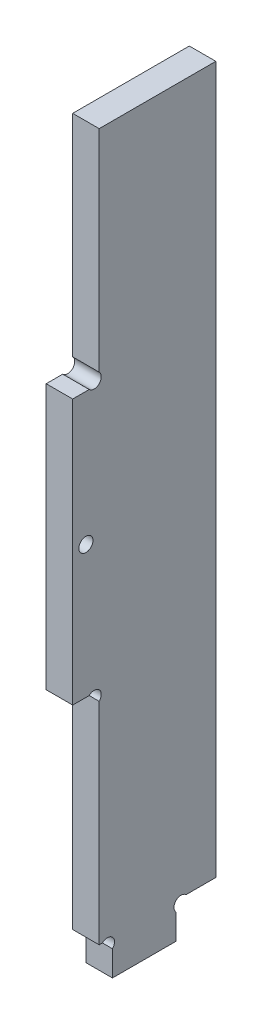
ISO-10303-21;
HEADER;
FILE_DESCRIPTION(('STEP AP214'),'2;1');
FILE_NAME('part.step','',(''),(''),'','','');
FILE_SCHEMA(('AUTOMOTIVE_DESIGN { 1 0 10303 214 1 1 1 1 }'));
ENDSEC;
DATA;
#1=APPLICATION_CONTEXT('core data for automotive mechanical design processes');
#2=APPLICATION_PROTOCOL_DEFINITION('international standard','automotive_design',2000,#1);
#3=PRODUCT_CONTEXT('',#1,'mechanical');
#4=PRODUCT('Part','Part','',(#3));
#5=PRODUCT_RELATED_PRODUCT_CATEGORY('part','',(#4));
#6=PRODUCT_DEFINITION_FORMATION('','',#4);
#7=PRODUCT_DEFINITION_CONTEXT('part definition',#1,'design');
#8=PRODUCT_DEFINITION('design','',#6,#7);
#9=PRODUCT_DEFINITION_SHAPE('','',#8);
#10=(LENGTH_UNIT() NAMED_UNIT(*) SI_UNIT(.MILLI.,.METRE.));
#11=(NAMED_UNIT(*) PLANE_ANGLE_UNIT() SI_UNIT($,.RADIAN.));
#12=(NAMED_UNIT(*) SI_UNIT($,.STERADIAN.) SOLID_ANGLE_UNIT());
#13=UNCERTAINTY_MEASURE_WITH_UNIT(LENGTH_MEASURE(1.E-05),#10,'distance_accuracy_value','');
#14=(GEOMETRIC_REPRESENTATION_CONTEXT(3) GLOBAL_UNCERTAINTY_ASSIGNED_CONTEXT((#13)) GLOBAL_UNIT_ASSIGNED_CONTEXT((#10,
#11,#12)) REPRESENTATION_CONTEXT('',''));
#15=CARTESIAN_POINT('',(0.,0.,0.));
#16=DIRECTION('',(0.,0.,1.));
#17=DIRECTION('',(1.,0.,0.));
#18=AXIS2_PLACEMENT_3D('',#15,#16,#17);
#19=CARTESIAN_POINT('',(6.,6.86862915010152,-24.5313708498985));
#20=DIRECTION('',(1.,0.,0.));
#21=DIRECTION('',(0.,0.,-1.));
#22=AXIS2_PLACEMENT_3D('',#19,#20,#21);
#23=PLANE('',#22);
#24=CARTESIAN_POINT('',(6.,6.86862915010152,-24.5313708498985));
#25=DIRECTION('',(-1.,0.,0.));
#26=DIRECTION('',(0.,0.,-1.));
#27=AXIS2_PLACEMENT_3D('',#24,#25,#26);
#28=CIRCLE('',#27,1.6);
#29=CARTESIAN_POINT('',(6.,5.73725830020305,-23.4));
#30=VERTEX_POINT('',#29);
#31=CARTESIAN_POINT('',(6.,8.,-25.6627416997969));
#32=VERTEX_POINT('',#31);
#33=EDGE_CURVE('E193',#30,#32,#28,.T.);
#34=ORIENTED_EDGE('',*,*,#33,.T.);
#35=DIRECTION('',(0.,0.,-1.));
#36=VECTOR('',#35,1.);
#37=CARTESIAN_POINT('',(6.,8.,-25.6627416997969));
#38=LINE('',#37,#36);
#39=CARTESIAN_POINT('',(6.,8.,-32.4));
#40=VERTEX_POINT('',#39);
#41=EDGE_CURVE('E101',#32,#40,#38,.T.);
#42=ORIENTED_EDGE('',*,*,#41,.T.);
#43=DIRECTION('',(0.,1.,0.));
#44=VECTOR('',#43,1.);
#45=CARTESIAN_POINT('',(6.,8.,-32.4));
#46=LINE('',#45,#44);
#47=CARTESIAN_POINT('',(6.,168.,-32.4));
#48=VERTEX_POINT('',#47);
#49=EDGE_CURVE('E232',#40,#48,#46,.T.);
#50=ORIENTED_EDGE('',*,*,#49,.T.);
#51=DIRECTION('',(0.,0.,1.));
#52=VECTOR('',#51,1.);
#53=CARTESIAN_POINT('',(6.,168.,-32.4));
#54=LINE('',#53,#52);
#55=CARTESIAN_POINT('',(6.,168.,-6.00000000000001));
#56=VERTEX_POINT('',#55);
#57=EDGE_CURVE('E251',#48,#56,#54,.T.);
#58=ORIENTED_EDGE('',*,*,#57,.T.);
#59=DIRECTION('',(0.,-1.,0.));
#60=VECTOR('',#59,1.);
#61=CARTESIAN_POINT('',(6.,120.262741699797,-6.00000000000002));
#62=LINE('',#61,#60);
#63=CARTESIAN_POINT('',(6.,120.262741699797,-6.00000000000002));
#64=VERTEX_POINT('',#63);
#65=EDGE_CURVE('E248',#56,#64,#62,.T.);
#66=ORIENTED_EDGE('',*,*,#65,.T.);
#67=CARTESIAN_POINT('',(6.,119.131370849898,-4.86862915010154));
#68=DIRECTION('',(-1.,0.,0.));
#69=DIRECTION('',(0.,0.,-1.));
#70=AXIS2_PLACEMENT_3D('',#67,#68,#69);
#71=CIRCLE('',#70,1.59999999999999);
#72=CARTESIAN_POINT('',(6.,118.,-3.73725830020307));
#73=VERTEX_POINT('',#72);
#74=EDGE_CURVE('E250',#64,#73,#71,.T.);
#75=ORIENTED_EDGE('',*,*,#74,.T.);
#76=DIRECTION('',(0.,0.,1.));
#77=VECTOR('',#76,1.);
#78=CARTESIAN_POINT('',(6.,118.,-3.73725830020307));
#79=LINE('',#78,#77);
#80=CARTESIAN_POINT('',(6.,118.,0.));
#81=VERTEX_POINT('',#80);
#82=EDGE_CURVE('E253',#73,#81,#79,.T.);
#83=ORIENTED_EDGE('',*,*,#82,.T.);
#84=DIRECTION('',(0.,-1.,0.));
#85=VECTOR('',#84,1.);
#86=CARTESIAN_POINT('',(6.,118.,0.));
#87=LINE('',#86,#85);
#88=CARTESIAN_POINT('',(6.,58.,0.));
#89=VERTEX_POINT('',#88);
#90=EDGE_CURVE('E259',#81,#89,#87,.T.);
#91=ORIENTED_EDGE('',*,*,#90,.T.);
#92=DIRECTION('',(0.,0.,-1.));
#93=VECTOR('',#92,1.);
#94=CARTESIAN_POINT('',(6.,58.,0.));
#95=LINE('',#94,#93);
#96=CARTESIAN_POINT('',(6.,58.,-3.73725830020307));
#97=VERTEX_POINT('',#96);
#98=EDGE_CURVE('E261',#89,#97,#95,.T.);
#99=ORIENTED_EDGE('',*,*,#98,.T.);
#100=CARTESIAN_POINT('',(6.,56.8686291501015,-4.86862915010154));
#101=DIRECTION('',(-1.,0.,0.));
#102=DIRECTION('',(0.,0.,1.));
#103=AXIS2_PLACEMENT_3D('',#100,#101,#102);
#104=CIRCLE('',#103,1.59999999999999);
#105=CARTESIAN_POINT('',(6.,55.7372583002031,-6.00000000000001));
#106=VERTEX_POINT('',#105);
#107=EDGE_CURVE('E263',#97,#106,#104,.T.);
#108=ORIENTED_EDGE('',*,*,#107,.T.);
#109=DIRECTION('',(0.,-1.,0.));
#110=VECTOR('',#109,1.);
#111=CARTESIAN_POINT('',(6.,55.7372583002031,-6.00000000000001));
#112=LINE('',#111,#110);
#113=CARTESIAN_POINT('',(6.,8.,-6.00000000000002));
#114=VERTEX_POINT('',#113);
#115=EDGE_CURVE('E265',#106,#114,#112,.T.);
#116=ORIENTED_EDGE('',*,*,#115,.T.);
#117=DIRECTION('',(0.,0.,-1.));
#118=VECTOR('',#117,1.);
#119=CARTESIAN_POINT('',(6.,8.,-6.7372583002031));
#120=LINE('',#119,#118);
#121=CARTESIAN_POINT('',(6.,8.,-6.7372583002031));
#122=VERTEX_POINT('',#121);
#123=EDGE_CURVE('E267',#114,#122,#120,.T.);
#124=ORIENTED_EDGE('',*,*,#123,.T.);
#125=CARTESIAN_POINT('',(6.,6.86862915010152,-7.86862915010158));
#126=DIRECTION('',(-1.,0.,0.));
#127=DIRECTION('',(0.,0.,1.));
#128=AXIS2_PLACEMENT_3D('',#125,#126,#127);
#129=CIRCLE('',#128,1.6);
#130=CARTESIAN_POINT('',(6.,5.73725830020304,-9.00000000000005));
#131=VERTEX_POINT('',#130);
#132=EDGE_CURVE('E144',#122,#131,#129,.T.);
#133=ORIENTED_EDGE('',*,*,#132,.T.);
#134=DIRECTION('',(0.,-1.,0.));
#135=VECTOR('',#134,1.);
#136=CARTESIAN_POINT('',(6.,5.73725830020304,-9.00000000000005));
#137=LINE('',#136,#135);
#138=CARTESIAN_POINT('',(6.,0.,-8.99999999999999));
#139=VERTEX_POINT('',#138);
#140=EDGE_CURVE('E138',#131,#139,#137,.T.);
#141=ORIENTED_EDGE('',*,*,#140,.T.);
#142=DIRECTION('',(0.,0.,-1.));
#143=VECTOR('',#142,1.);
#144=CARTESIAN_POINT('',(6.,0.,-8.99999999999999));
#145=LINE('',#144,#143);
#146=CARTESIAN_POINT('',(6.,0.,-23.4));
#147=VERTEX_POINT('',#146);
#148=EDGE_CURVE('E142',#139,#147,#145,.T.);
#149=ORIENTED_EDGE('',*,*,#148,.T.);
#150=DIRECTION('',(0.,1.,0.));
#151=VECTOR('',#150,1.);
#152=CARTESIAN_POINT('',(6.,0.,-23.4));
#153=LINE('',#152,#151);
#154=EDGE_CURVE('E34',#147,#30,#153,.T.);
#155=ORIENTED_EDGE('',*,*,#154,.T.);
#156=EDGE_LOOP('',(#34,#42,#50,#58,#66,#75,#83,#91,#99,#108,#116,#124,#133,#141,#149,#155));
#157=FACE_BOUND('',#156,.T.);
#158=CARTESIAN_POINT('',(6.,88.,-3.));
#159=DIRECTION('',(1.,0.,0.));
#160=DIRECTION('',(0.,0.,-1.));
#161=AXIS2_PLACEMENT_3D('',#158,#159,#160);
#162=CIRCLE('',#161,1.6);
#163=CARTESIAN_POINT('',(6.,88.,-4.6));
#164=VERTEX_POINT('',#163);
#165=EDGE_CURVE('E166',#164,#164,#162,.T.);
#166=ORIENTED_EDGE('',*,*,#165,.F.);
#167=EDGE_LOOP('',(#166));
#168=FACE_BOUND('',#167,.T.);
#169=ADVANCED_FACE('F17',(#157,#168),#23,.T.);
#170=CARTESIAN_POINT('',(0.,6.86862915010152,-24.5313708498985));
#171=DIRECTION('',(1.,0.,0.));
#172=DIRECTION('',(0.,0.,-1.));
#173=AXIS2_PLACEMENT_3D('',#170,#171,#172);
#174=PLANE('',#173);
#175=CARTESIAN_POINT('',(0.,6.86862915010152,-24.5313708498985));
#176=DIRECTION('',(-1.,0.,0.));
#177=DIRECTION('',(0.,0.,-1.));
#178=AXIS2_PLACEMENT_3D('',#175,#176,#177);
#179=CIRCLE('',#178,1.6);
#180=CARTESIAN_POINT('',(0.,5.73725830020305,-23.4));
#181=VERTEX_POINT('',#180);
#182=CARTESIAN_POINT('',(0.,8.,-25.6627416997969));
#183=VERTEX_POINT('',#182);
#184=EDGE_CURVE('E162',#181,#183,#179,.T.);
#185=ORIENTED_EDGE('',*,*,#184,.F.);
#186=DIRECTION('',(0.,1.,0.));
#187=VECTOR('',#186,1.);
#188=CARTESIAN_POINT('',(0.,0.,-23.4));
#189=LINE('',#188,#187);
#190=CARTESIAN_POINT('',(0.,0.,-23.4));
#191=VERTEX_POINT('',#190);
#192=EDGE_CURVE('E93',#191,#181,#189,.T.);
#193=ORIENTED_EDGE('',*,*,#192,.F.);
#194=DIRECTION('',(0.,0.,-1.));
#195=VECTOR('',#194,1.);
#196=CARTESIAN_POINT('',(0.,0.,-8.99999999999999));
#197=LINE('',#196,#195);
#198=CARTESIAN_POINT('',(0.,0.,-8.99999999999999));
#199=VERTEX_POINT('',#198);
#200=EDGE_CURVE('E87',#199,#191,#197,.T.);
#201=ORIENTED_EDGE('',*,*,#200,.F.);
#202=DIRECTION('',(0.,-1.,0.));
#203=VECTOR('',#202,1.);
#204=CARTESIAN_POINT('',(0.,5.73725830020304,-9.00000000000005));
#205=LINE('',#204,#203);
#206=CARTESIAN_POINT('',(0.,5.73725830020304,-9.00000000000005));
#207=VERTEX_POINT('',#206);
#208=EDGE_CURVE('E152',#207,#199,#205,.T.);
#209=ORIENTED_EDGE('',*,*,#208,.F.);
#210=CARTESIAN_POINT('',(0.,6.86862915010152,-7.86862915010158));
#211=DIRECTION('',(-1.,0.,0.));
#212=DIRECTION('',(0.,0.,1.));
#213=AXIS2_PLACEMENT_3D('',#210,#211,#212);
#214=CIRCLE('',#213,1.6);
#215=CARTESIAN_POINT('',(0.,8.,-6.7372583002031));
#216=VERTEX_POINT('',#215);
#217=EDGE_CURVE('E188',#216,#207,#214,.T.);
#218=ORIENTED_EDGE('',*,*,#217,.F.);
#219=DIRECTION('',(0.,0.,-1.));
#220=VECTOR('',#219,1.);
#221=CARTESIAN_POINT('',(0.,8.,-6.7372583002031));
#222=LINE('',#221,#220);
#223=CARTESIAN_POINT('',(0.,8.,-6.00000000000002));
#224=VERTEX_POINT('',#223);
#225=EDGE_CURVE('E186',#224,#216,#222,.T.);
#226=ORIENTED_EDGE('',*,*,#225,.F.);
#227=DIRECTION('',(0.,-1.,0.));
#228=VECTOR('',#227,1.);
#229=CARTESIAN_POINT('',(0.,55.7372583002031,-6.00000000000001));
#230=LINE('',#229,#228);
#231=CARTESIAN_POINT('',(0.,55.7372583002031,-6.00000000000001));
#232=VERTEX_POINT('',#231);
#233=EDGE_CURVE('E184',#232,#224,#230,.T.);
#234=ORIENTED_EDGE('',*,*,#233,.F.);
#235=CARTESIAN_POINT('',(0.,56.8686291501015,-4.86862915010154));
#236=DIRECTION('',(-1.,0.,0.));
#237=DIRECTION('',(0.,0.,1.));
#238=AXIS2_PLACEMENT_3D('',#235,#236,#237);
#239=CIRCLE('',#238,1.59999999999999);
#240=CARTESIAN_POINT('',(0.,58.,-3.73725830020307));
#241=VERTEX_POINT('',#240);
#242=EDGE_CURVE('E182',#241,#232,#239,.T.);
#243=ORIENTED_EDGE('',*,*,#242,.F.);
#244=DIRECTION('',(0.,0.,-1.));
#245=VECTOR('',#244,1.);
#246=CARTESIAN_POINT('',(0.,58.,0.));
#247=LINE('',#246,#245);
#248=CARTESIAN_POINT('',(0.,58.,0.));
#249=VERTEX_POINT('',#248);
#250=EDGE_CURVE('E180',#249,#241,#247,.T.);
#251=ORIENTED_EDGE('',*,*,#250,.F.);
#252=DIRECTION('',(0.,-1.,0.));
#253=VECTOR('',#252,1.);
#254=CARTESIAN_POINT('',(0.,118.,0.));
#255=LINE('',#254,#253);
#256=CARTESIAN_POINT('',(0.,118.,0.));
#257=VERTEX_POINT('',#256);
#258=EDGE_CURVE('E178',#257,#249,#255,.T.);
#259=ORIENTED_EDGE('',*,*,#258,.F.);
#260=DIRECTION('',(0.,0.,1.));
#261=VECTOR('',#260,1.);
#262=CARTESIAN_POINT('',(0.,118.,-3.73725830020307));
#263=LINE('',#262,#261);
#264=CARTESIAN_POINT('',(0.,118.,-3.73725830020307));
#265=VERTEX_POINT('',#264);
#266=EDGE_CURVE('E176',#265,#257,#263,.T.);
#267=ORIENTED_EDGE('',*,*,#266,.F.);
#268=CARTESIAN_POINT('',(0.,119.131370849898,-4.86862915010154));
#269=DIRECTION('',(-1.,0.,0.));
#270=DIRECTION('',(0.,0.,-1.));
#271=AXIS2_PLACEMENT_3D('',#268,#269,#270);
#272=CIRCLE('',#271,1.59999999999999);
#273=CARTESIAN_POINT('',(0.,120.262741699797,-6.00000000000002));
#274=VERTEX_POINT('',#273);
#275=EDGE_CURVE('E174',#274,#265,#272,.T.);
#276=ORIENTED_EDGE('',*,*,#275,.F.);
#277=DIRECTION('',(0.,-1.,0.));
#278=VECTOR('',#277,1.);
#279=CARTESIAN_POINT('',(0.,120.262741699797,-6.00000000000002));
#280=LINE('',#279,#278);
#281=CARTESIAN_POINT('',(0.,168.,-6.00000000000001));
#282=VERTEX_POINT('',#281);
#283=EDGE_CURVE('E172',#282,#274,#280,.T.);
#284=ORIENTED_EDGE('',*,*,#283,.F.);
#285=DIRECTION('',(0.,0.,1.));
#286=VECTOR('',#285,1.);
#287=CARTESIAN_POINT('',(0.,168.,-32.4));
#288=LINE('',#287,#286);
#289=CARTESIAN_POINT('',(0.,168.,-32.4));
#290=VERTEX_POINT('',#289);
#291=EDGE_CURVE('E170',#290,#282,#288,.T.);
#292=ORIENTED_EDGE('',*,*,#291,.F.);
#293=DIRECTION('',(0.,1.,0.));
#294=VECTOR('',#293,1.);
#295=CARTESIAN_POINT('',(0.,8.,-32.4));
#296=LINE('',#295,#294);
#297=CARTESIAN_POINT('',(0.,8.,-32.4));
#298=VERTEX_POINT('',#297);
#299=EDGE_CURVE('E168',#298,#290,#296,.T.);
#300=ORIENTED_EDGE('',*,*,#299,.F.);
#301=DIRECTION('',(0.,0.,-1.));
#302=VECTOR('',#301,1.);
#303=CARTESIAN_POINT('',(0.,8.,-25.6627416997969));
#304=LINE('',#303,#302);
#305=EDGE_CURVE('E165',#183,#298,#304,.T.);
#306=ORIENTED_EDGE('',*,*,#305,.F.);
#307=EDGE_LOOP('',(#185,#193,#201,#209,#218,#226,#234,#243,#251,#259,#267,#276,#284,#292,#300,#306));
#308=FACE_BOUND('',#307,.T.);
#309=CARTESIAN_POINT('',(0.,88.,-3.));
#310=DIRECTION('',(1.,0.,0.));
#311=DIRECTION('',(0.,0.,-1.));
#312=AXIS2_PLACEMENT_3D('',#309,#310,#311);
#313=CIRCLE('',#312,1.6);
#314=CARTESIAN_POINT('',(0.,88.,-4.6));
#315=VERTEX_POINT('',#314);
#316=EDGE_CURVE('E474',#315,#315,#313,.T.);
#317=ORIENTED_EDGE('',*,*,#316,.T.);
#318=EDGE_LOOP('',(#317));
#319=FACE_BOUND('',#318,.T.);
#320=ADVANCED_FACE('F236',(#308,#319),#174,.F.);
#321=CARTESIAN_POINT('',(6.,6.86862915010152,-24.5313708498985));
#322=DIRECTION('',(-1.,0.,0.));
#323=DIRECTION('',(0.,0.,1.));
#324=AXIS2_PLACEMENT_3D('',#321,#322,#323);
#325=CYLINDRICAL_SURFACE('',#324,1.6);
#326=ORIENTED_EDGE('',*,*,#184,.T.);
#327=DIRECTION('',(-1.,0.,0.));
#328=VECTOR('',#327,1.);
#329=CARTESIAN_POINT('',(6.,8.,-25.6627416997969));
#330=LINE('',#329,#328);
#331=EDGE_CURVE('E11',#32,#183,#330,.T.);
#332=ORIENTED_EDGE('',*,*,#331,.F.);
#333=ORIENTED_EDGE('',*,*,#33,.F.);
#334=DIRECTION('',(-1.,0.,0.));
#335=VECTOR('',#334,1.);
#336=CARTESIAN_POINT('',(6.,5.73725830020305,-23.4));
#337=LINE('',#336,#335);
#338=EDGE_CURVE('E158',#30,#181,#337,.T.);
#339=ORIENTED_EDGE('',*,*,#338,.T.);
#340=EDGE_LOOP('',(#326,#332,#333,#339));
#341=FACE_BOUND('',#340,.T.);
#342=ADVANCED_FACE('F19',(#341),#325,.F.);
#343=CARTESIAN_POINT('',(6.,8.,-25.6627416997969));
#344=DIRECTION('',(0.,1.,0.));
#345=DIRECTION('',(0.,0.,1.));
#346=AXIS2_PLACEMENT_3D('',#343,#344,#345);
#347=PLANE('',#346);
#348=ORIENTED_EDGE('',*,*,#305,.T.);
#349=DIRECTION('',(-1.,0.,0.));
#350=VECTOR('',#349,1.);
#351=CARTESIAN_POINT('',(6.,8.,-32.4));
#352=LINE('',#351,#350);
#353=EDGE_CURVE('E26',#40,#298,#352,.T.);
#354=ORIENTED_EDGE('',*,*,#353,.F.);
#355=ORIENTED_EDGE('',*,*,#41,.F.);
#356=ORIENTED_EDGE('',*,*,#331,.T.);
#357=EDGE_LOOP('',(#348,#354,#355,#356));
#358=FACE_BOUND('',#357,.T.);
#359=ADVANCED_FACE('F305',(#358),#347,.F.);
#360=CARTESIAN_POINT('',(6.,8.,-32.4));
#361=DIRECTION('',(0.,0.,1.));
#362=DIRECTION('',(1.,0.,0.));
#363=AXIS2_PLACEMENT_3D('',#360,#361,#362);
#364=PLANE('',#363);
#365=ORIENTED_EDGE('',*,*,#299,.T.);
#366=DIRECTION('',(-1.,0.,0.));
#367=VECTOR('',#366,1.);
#368=CARTESIAN_POINT('',(6.,168.,-32.4));
#369=LINE('',#368,#367);
#370=EDGE_CURVE('E224',#48,#290,#369,.T.);
#371=ORIENTED_EDGE('',*,*,#370,.F.);
#372=ORIENTED_EDGE('',*,*,#49,.F.);
#373=ORIENTED_EDGE('',*,*,#353,.T.);
#374=EDGE_LOOP('',(#365,#371,#372,#373));
#375=FACE_BOUND('',#374,.T.);
#376=ADVANCED_FACE('F230',(#375),#364,.F.);
#377=CARTESIAN_POINT('',(6.,168.,-32.4));
#378=DIRECTION('',(0.,-1.,0.));
#379=DIRECTION('',(0.,0.,-1.));
#380=AXIS2_PLACEMENT_3D('',#377,#378,#379);
#381=PLANE('',#380);
#382=ORIENTED_EDGE('',*,*,#291,.T.);
#383=DIRECTION('',(-1.,0.,0.));
#384=VECTOR('',#383,1.);
#385=CARTESIAN_POINT('',(6.,168.,-6.00000000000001));
#386=LINE('',#385,#384);
#387=EDGE_CURVE('E221',#56,#282,#386,.T.);
#388=ORIENTED_EDGE('',*,*,#387,.F.);
#389=ORIENTED_EDGE('',*,*,#57,.F.);
#390=ORIENTED_EDGE('',*,*,#370,.T.);
#391=EDGE_LOOP('',(#382,#388,#389,#390));
#392=FACE_BOUND('',#391,.T.);
#393=ADVANCED_FACE('F242',(#392),#381,.F.);
#394=CARTESIAN_POINT('',(6.,120.262741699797,-6.00000000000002));
#395=DIRECTION('',(0.,0.,-1.));
#396=DIRECTION('',(0.,1.,0.));
#397=AXIS2_PLACEMENT_3D('',#394,#395,#396);
#398=PLANE('',#397);
#399=ORIENTED_EDGE('',*,*,#283,.T.);
#400=DIRECTION('',(-1.,0.,0.));
#401=VECTOR('',#400,1.);
#402=CARTESIAN_POINT('',(6.,120.262741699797,-6.00000000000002));
#403=LINE('',#402,#401);
#404=EDGE_CURVE('E218',#64,#274,#403,.T.);
#405=ORIENTED_EDGE('',*,*,#404,.F.);
#406=ORIENTED_EDGE('',*,*,#65,.F.);
#407=ORIENTED_EDGE('',*,*,#387,.T.);
#408=EDGE_LOOP('',(#399,#405,#406,#407));
#409=FACE_BOUND('',#408,.T.);
#410=ADVANCED_FACE('F246',(#409),#398,.F.);
#411=CARTESIAN_POINT('',(6.,119.131370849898,-4.86862915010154));
#412=DIRECTION('',(-1.,0.,0.));
#413=DIRECTION('',(0.,0.,1.));
#414=AXIS2_PLACEMENT_3D('',#411,#412,#413);
#415=CYLINDRICAL_SURFACE('',#414,1.59999999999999);
#416=ORIENTED_EDGE('',*,*,#275,.T.);
#417=DIRECTION('',(-1.,0.,0.));
#418=VECTOR('',#417,1.);
#419=CARTESIAN_POINT('',(6.,118.,-3.73725830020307));
#420=LINE('',#419,#418);
#421=EDGE_CURVE('E215',#73,#265,#420,.T.);
#422=ORIENTED_EDGE('',*,*,#421,.F.);
#423=ORIENTED_EDGE('',*,*,#74,.F.);
#424=ORIENTED_EDGE('',*,*,#404,.T.);
#425=EDGE_LOOP('',(#416,#422,#423,#424));
#426=FACE_BOUND('',#425,.T.);
#427=ADVANCED_FACE('F320',(#426),#415,.F.);
#428=CARTESIAN_POINT('',(6.,118.,-3.73725830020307));
#429=DIRECTION('',(0.,-1.,0.));
#430=DIRECTION('',(0.,0.,-1.));
#431=AXIS2_PLACEMENT_3D('',#428,#429,#430);
#432=PLANE('',#431);
#433=ORIENTED_EDGE('',*,*,#266,.T.);
#434=DIRECTION('',(-1.,0.,0.));
#435=VECTOR('',#434,1.);
#436=CARTESIAN_POINT('',(6.,118.,0.));
#437=LINE('',#436,#435);
#438=EDGE_CURVE('E212',#81,#257,#437,.T.);
#439=ORIENTED_EDGE('',*,*,#438,.F.);
#440=ORIENTED_EDGE('',*,*,#82,.F.);
#441=ORIENTED_EDGE('',*,*,#421,.T.);
#442=EDGE_LOOP('',(#433,#439,#440,#441));
#443=FACE_BOUND('',#442,.T.);
#444=ADVANCED_FACE('F323',(#443),#432,.F.);
#445=CARTESIAN_POINT('',(6.,118.,0.));
#446=DIRECTION('',(0.,0.,-1.));
#447=DIRECTION('',(0.,1.,0.));
#448=AXIS2_PLACEMENT_3D('',#445,#446,#447);
#449=PLANE('',#448);
#450=ORIENTED_EDGE('',*,*,#258,.T.);
#451=DIRECTION('',(-1.,0.,0.));
#452=VECTOR('',#451,1.);
#453=CARTESIAN_POINT('',(6.,58.,0.));
#454=LINE('',#453,#452);
#455=EDGE_CURVE('E209',#89,#249,#454,.T.);
#456=ORIENTED_EDGE('',*,*,#455,.F.);
#457=ORIENTED_EDGE('',*,*,#90,.F.);
#458=ORIENTED_EDGE('',*,*,#438,.T.);
#459=EDGE_LOOP('',(#450,#456,#457,#458));
#460=FACE_BOUND('',#459,.T.);
#461=ADVANCED_FACE('F327',(#460),#449,.F.);
#462=CARTESIAN_POINT('',(6.,58.,0.));
#463=DIRECTION('',(0.,1.,0.));
#464=DIRECTION('',(0.,0.,1.));
#465=AXIS2_PLACEMENT_3D('',#462,#463,#464);
#466=PLANE('',#465);
#467=ORIENTED_EDGE('',*,*,#250,.T.);
#468=DIRECTION('',(-1.,0.,0.));
#469=VECTOR('',#468,1.);
#470=CARTESIAN_POINT('',(6.,58.,-3.73725830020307));
#471=LINE('',#470,#469);
#472=EDGE_CURVE('E206',#97,#241,#471,.T.);
#473=ORIENTED_EDGE('',*,*,#472,.F.);
#474=ORIENTED_EDGE('',*,*,#98,.F.);
#475=ORIENTED_EDGE('',*,*,#455,.T.);
#476=EDGE_LOOP('',(#467,#473,#474,#475));
#477=FACE_BOUND('',#476,.T.);
#478=ADVANCED_FACE('F331',(#477),#466,.F.);
#479=CARTESIAN_POINT('',(6.,56.8686291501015,-4.86862915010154));
#480=DIRECTION('',(-1.,0.,0.));
#481=DIRECTION('',(0.,0.,1.));
#482=AXIS2_PLACEMENT_3D('',#479,#480,#481);
#483=CYLINDRICAL_SURFACE('',#482,1.59999999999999);
#484=ORIENTED_EDGE('',*,*,#242,.T.);
#485=DIRECTION('',(-1.,0.,0.));
#486=VECTOR('',#485,1.);
#487=CARTESIAN_POINT('',(6.,55.7372583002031,-6.00000000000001));
#488=LINE('',#487,#486);
#489=EDGE_CURVE('E203',#106,#232,#488,.T.);
#490=ORIENTED_EDGE('',*,*,#489,.F.);
#491=ORIENTED_EDGE('',*,*,#107,.F.);
#492=ORIENTED_EDGE('',*,*,#472,.T.);
#493=EDGE_LOOP('',(#484,#490,#491,#492));
#494=FACE_BOUND('',#493,.T.);
#495=ADVANCED_FACE('F335',(#494),#483,.F.);
#496=CARTESIAN_POINT('',(6.,55.7372583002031,-6.00000000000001));
#497=DIRECTION('',(0.,0.,-1.));
#498=DIRECTION('',(0.,1.,0.));
#499=AXIS2_PLACEMENT_3D('',#496,#497,#498);
#500=PLANE('',#499);
#501=ORIENTED_EDGE('',*,*,#233,.T.);
#502=DIRECTION('',(-1.,0.,0.));
#503=VECTOR('',#502,1.);
#504=CARTESIAN_POINT('',(6.,8.,-6.00000000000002));
#505=LINE('',#504,#503);
#506=EDGE_CURVE('E200',#114,#224,#505,.T.);
#507=ORIENTED_EDGE('',*,*,#506,.F.);
#508=ORIENTED_EDGE('',*,*,#115,.F.);
#509=ORIENTED_EDGE('',*,*,#489,.T.);
#510=EDGE_LOOP('',(#501,#507,#508,#509));
#511=FACE_BOUND('',#510,.T.);
#512=ADVANCED_FACE('F339',(#511),#500,.F.);
#513=CARTESIAN_POINT('',(6.,8.,-6.7372583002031));
#514=DIRECTION('',(0.,1.,0.));
#515=DIRECTION('',(0.,0.,1.));
#516=AXIS2_PLACEMENT_3D('',#513,#514,#515);
#517=PLANE('',#516);
#518=ORIENTED_EDGE('',*,*,#225,.T.);
#519=DIRECTION('',(-1.,0.,0.));
#520=VECTOR('',#519,1.);
#521=CARTESIAN_POINT('',(6.,8.,-6.7372583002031));
#522=LINE('',#521,#520);
#523=EDGE_CURVE('E197',#122,#216,#522,.T.);
#524=ORIENTED_EDGE('',*,*,#523,.F.);
#525=ORIENTED_EDGE('',*,*,#123,.F.);
#526=ORIENTED_EDGE('',*,*,#506,.T.);
#527=EDGE_LOOP('',(#518,#524,#525,#526));
#528=FACE_BOUND('',#527,.T.);
#529=ADVANCED_FACE('F273',(#528),#517,.F.);
#530=CARTESIAN_POINT('',(6.,6.86862915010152,-7.86862915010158));
#531=DIRECTION('',(-1.,0.,0.));
#532=DIRECTION('',(0.,0.,1.));
#533=AXIS2_PLACEMENT_3D('',#530,#531,#532);
#534=CYLINDRICAL_SURFACE('',#533,1.6);
#535=ORIENTED_EDGE('',*,*,#217,.T.);
#536=DIRECTION('',(-1.,0.,0.));
#537=VECTOR('',#536,1.);
#538=CARTESIAN_POINT('',(6.,5.73725830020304,-9.00000000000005));
#539=LINE('',#538,#537);
#540=EDGE_CURVE('E153',#131,#207,#539,.T.);
#541=ORIENTED_EDGE('',*,*,#540,.F.);
#542=ORIENTED_EDGE('',*,*,#132,.F.);
#543=ORIENTED_EDGE('',*,*,#523,.T.);
#544=EDGE_LOOP('',(#535,#541,#542,#543));
#545=FACE_BOUND('',#544,.T.);
#546=ADVANCED_FACE('F277',(#545),#534,.F.);
#547=CARTESIAN_POINT('',(6.,5.73725830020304,-9.00000000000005));
#548=DIRECTION('',(0.,0.,-1.));
#549=DIRECTION('',(0.,1.,0.));
#550=AXIS2_PLACEMENT_3D('',#547,#548,#549);
#551=PLANE('',#550);
#552=ORIENTED_EDGE('',*,*,#208,.T.);
#553=DIRECTION('',(-1.,0.,0.));
#554=VECTOR('',#553,1.);
#555=CARTESIAN_POINT('',(6.,0.,-8.99999999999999));
#556=LINE('',#555,#554);
#557=EDGE_CURVE('E149',#139,#199,#556,.T.);
#558=ORIENTED_EDGE('',*,*,#557,.F.);
#559=ORIENTED_EDGE('',*,*,#140,.F.);
#560=ORIENTED_EDGE('',*,*,#540,.T.);
#561=EDGE_LOOP('',(#552,#558,#559,#560));
#562=FACE_BOUND('',#561,.T.);
#563=ADVANCED_FACE('F150',(#562),#551,.F.);
#564=CARTESIAN_POINT('',(6.,0.,-8.99999999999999));
#565=DIRECTION('',(0.,1.,0.));
#566=DIRECTION('',(0.,0.,1.));
#567=AXIS2_PLACEMENT_3D('',#564,#565,#566);
#568=PLANE('',#567);
#569=ORIENTED_EDGE('',*,*,#200,.T.);
#570=DIRECTION('',(-1.,0.,0.));
#571=VECTOR('',#570,1.);
#572=CARTESIAN_POINT('',(6.,0.,-23.4));
#573=LINE('',#572,#571);
#574=EDGE_CURVE('E154',#147,#191,#573,.T.);
#575=ORIENTED_EDGE('',*,*,#574,.F.);
#576=ORIENTED_EDGE('',*,*,#148,.F.);
#577=ORIENTED_EDGE('',*,*,#557,.T.);
#578=EDGE_LOOP('',(#569,#575,#576,#577));
#579=FACE_BOUND('',#578,.T.);
#580=ADVANCED_FACE('F156',(#579),#568,.F.);
#581=CARTESIAN_POINT('',(6.,0.,-23.4));
#582=DIRECTION('',(0.,0.,1.));
#583=DIRECTION('',(1.,0.,0.));
#584=AXIS2_PLACEMENT_3D('',#581,#582,#583);
#585=PLANE('',#584);
#586=ORIENTED_EDGE('',*,*,#192,.T.);
#587=ORIENTED_EDGE('',*,*,#338,.F.);
#588=ORIENTED_EDGE('',*,*,#154,.F.);
#589=ORIENTED_EDGE('',*,*,#574,.T.);
#590=EDGE_LOOP('',(#586,#587,#588,#589));
#591=FACE_BOUND('',#590,.T.);
#592=ADVANCED_FACE('F281',(#591),#585,.F.);
#593=CARTESIAN_POINT('',(6.,88.,-3.));
#594=DIRECTION('',(-1.,0.,0.));
#595=DIRECTION('',(0.,0.,1.));
#596=AXIS2_PLACEMENT_3D('',#593,#594,#595);
#597=CYLINDRICAL_SURFACE('',#596,1.6);
#598=ORIENTED_EDGE('',*,*,#165,.T.);
#599=EDGE_LOOP('',(#598));
#600=FACE_BOUND('',#599,.T.);
#601=ORIENTED_EDGE('',*,*,#316,.F.);
#602=EDGE_LOOP('',(#601));
#603=FACE_BOUND('',#602,.T.);
#604=ADVANCED_FACE('F283',(#600,#603),#597,.F.);
#605=CLOSED_SHELL('',(#169,#320,#342,#359,#376,#393,#410,#427,#444,#461,#478,#495,#512,#529,
#546,#563,#580,#592,#604));
#606=MANIFOLD_SOLID_BREP('B1',#605);
#607=ADVANCED_BREP_SHAPE_REPRESENTATION('',(#18,#606),#14);
#608=SHAPE_DEFINITION_REPRESENTATION(#9,#607);
ENDSEC;
END-ISO-10303-21;
